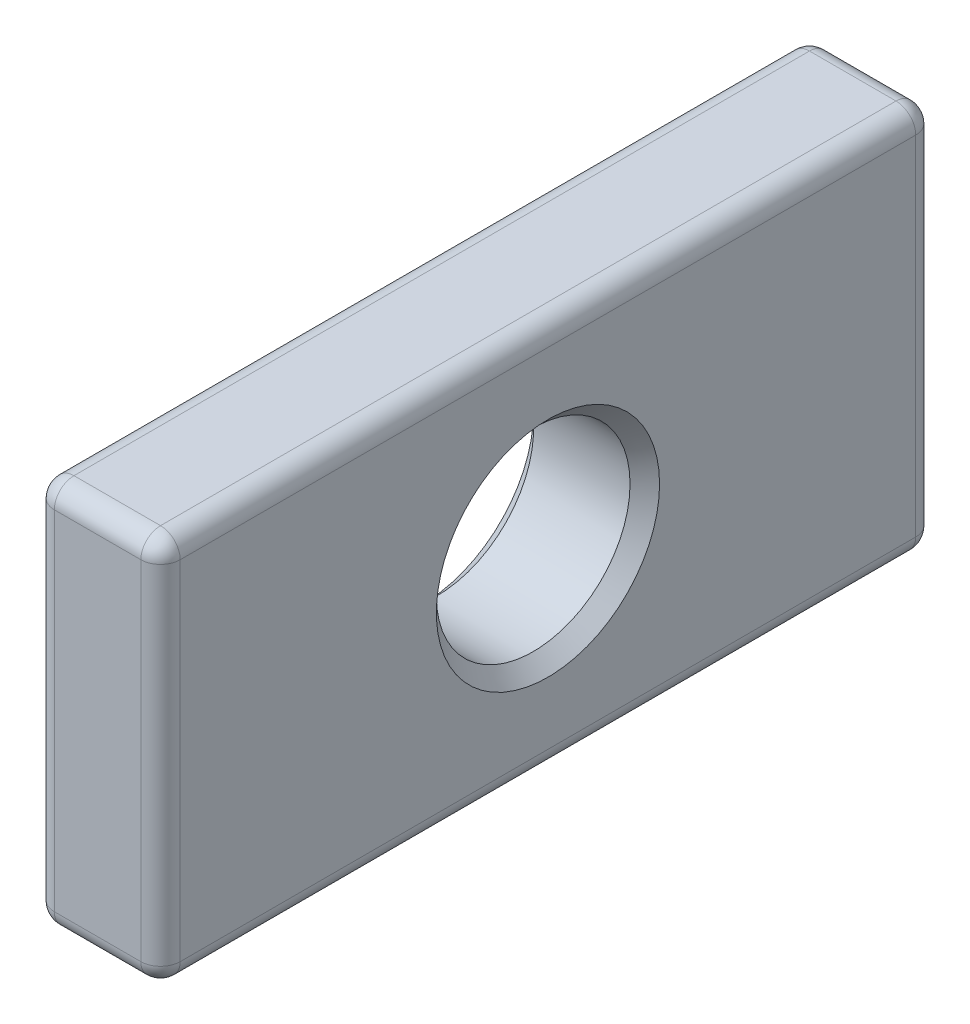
from build123d import *

# Parameters (mm, degrees)
SKETCH1_W           = 40
SKETCH1_H           = 20
SKETCH1_R           = 5
BOSS_EXTRUDE1_DEPTH = 3.25
FILLET1_R           = 1.016
CHAMFER1_SIZE       = 0.762


with BuildPart() as part:
    # Sketch1 → Boss-Extrude1 (new, symmetric)
    with BuildSketch(Plane(origin=(0, 0, 0), x_dir=(0, 0, -1), z_dir=(1, 0, 0))):
        Rectangle(SKETCH1_W, SKETCH1_H)
        with Locations(Location((0, 0, 0), (0, 0, 180))):
            Circle(SKETCH1_R, mode=Mode.SUBTRACT)
    extrude(amount=BOSS_EXTRUDE1_DEPTH, both=True)

    # Fillet1
    fillet1_edges = [part.edges().sort_by_distance(p)[0] for p in [
        (3.25, 0, 20),
        (3.25, -10, 0),
        (3.25, 0, -20),
        (-3.25, -10, 0),
        (-3.25, 0, 20),
        (-3.25, 10, 0),
        (-3.25, 0, -20),
        (3.25, 10, 0),
        (0, -10, -20),
        (0, -10, 20),
        (0, 10, 20),
        (0, 10, -20),
    ]]
    fillet(fillet1_edges, radius=FILLET1_R)

    # Chamfer1
    chamfer1_edges = [part.edges().sort_by_distance(p)[0] for p in [
        (-3.25, 0, -5),
        (3.25, 0, -5),
    ]]
    chamfer(chamfer1_edges, length=CHAMFER1_SIZE)


solid = part.part
